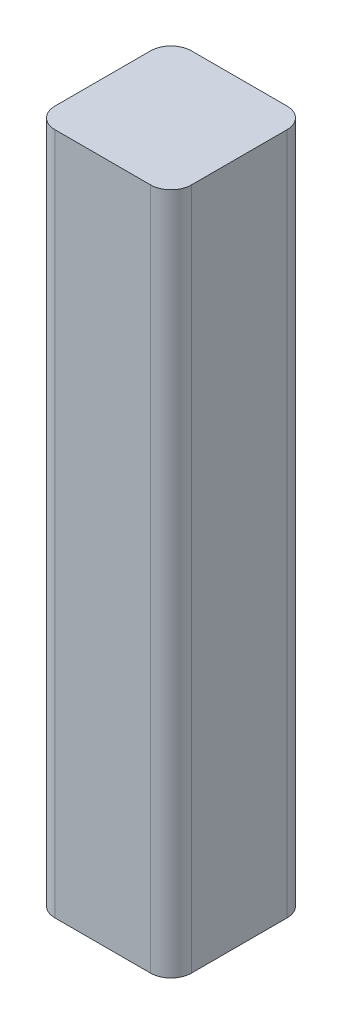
from build123d import *

# Parameters (mm, degrees)
SKETCH1_W           = 20
SKETCH1_H           = 20
BOSS_EXTRUDE1_DEPTH = 100
FILLET1_R           = 3


with BuildPart() as part:
    # Sketch1 → Boss-Extrude1 (new body)
    with BuildSketch(Plane(origin=(0, 0, 0), x_dir=(1, 0, 0), z_dir=(0, 1, 0))):
        Rectangle(SKETCH1_W, SKETCH1_H)
    extrude(amount=BOSS_EXTRUDE1_DEPTH)

    # Fillet1
    fillet1_edges = [part.edges().sort_by_distance(p)[0] for p in [
        (-10, 50, -10),
        (10, 50, -10),
        (10, 50, 10),
        (-10, 50, 10),
    ]]
    fillet(fillet1_edges, radius=FILLET1_R)


solid = part.part
